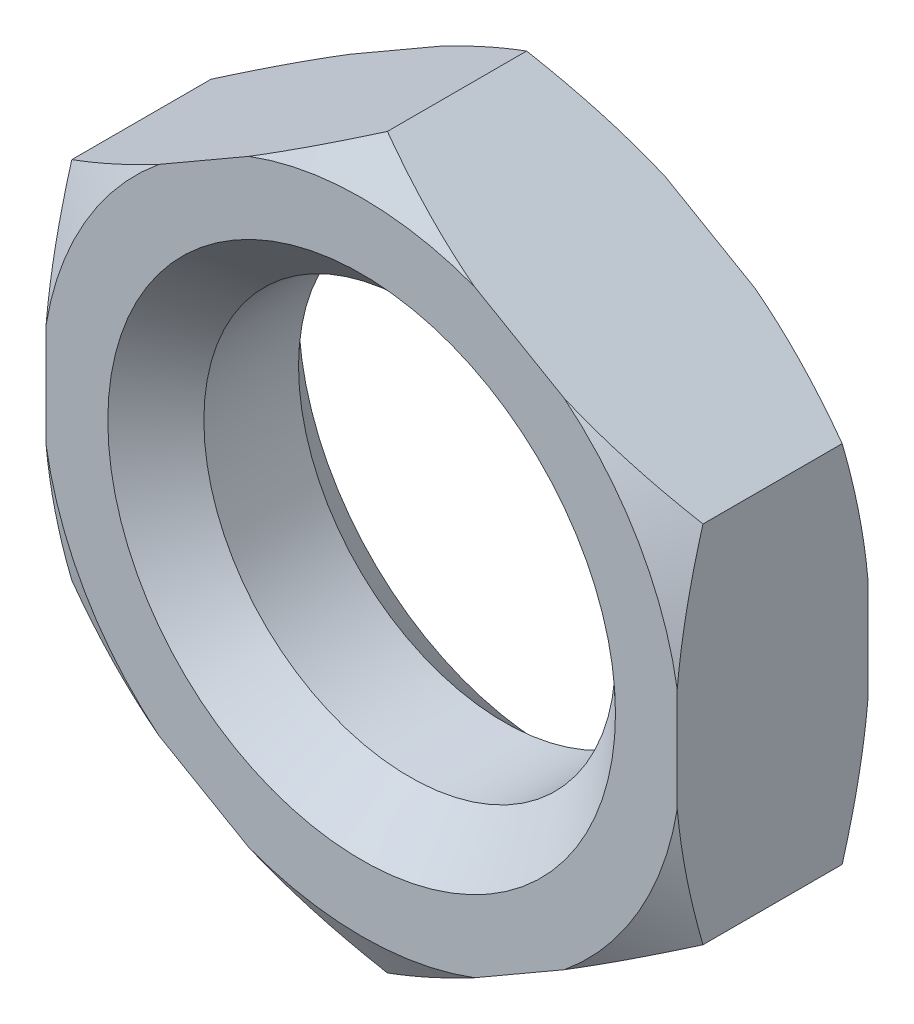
from build123d import *

# Parameters (mm, degrees)
BOSS_EXTRUDE1_DEPTH = 6.95
SKETCH6_R           = 15
CUT_EXTRUDE1_DEPTH  = 13.9
CHAMFER1_SIZE       = 3.5


with BuildPart() as part:
    # Sketch3 → Boss-Extrude1 (new, symmetric)
    with BuildSketch(Plane.XY):
        Polygon((0, 26.558112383), (-23, 13.279056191), (-23, -13.279056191), (0, -26.558112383), (23, -13.279056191), (23, 13.279056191), align=None)
    extrude(amount=BOSS_EXTRUDE1_DEPTH, both=True)

    # Sketch5 → Cut-Revolve1 (revolve, cut)
    with BuildSketch(Plane(origin=(0, 0, 0), x_dir=(0, 0, -1), z_dir=(1, 0, 0))):
        Polygon((-6.95, 26.558112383), (-6.95, 23.308112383), (-5.073611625, 26.558112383), align=None)
    cut_revolve1 = revolve(axis=Axis((0, 0, 5.457798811), (0, 0, -1)), mode=Mode.SUBTRACT)

    # Mirror1: Cut-Revolve1 across plane
    add(cut_revolve1.mirror(Plane.XY), mode=Mode.SUBTRACT)

    # Sketch6 → Cut-Extrude1 (cut)
    with BuildSketch(Plane.XY.offset(6.95)):
        Circle(SKETCH6_R)
    extrude(amount=-CUT_EXTRUDE1_DEPTH, mode=Mode.SUBTRACT)

    # Chamfer1
    chamfer1_edges = [part.edges().sort_by_distance(p)[0] for p in [
        (-15, 0, -6.95),
        (-15, 0, 6.95),
    ]]
    chamfer(chamfer1_edges, length=CHAMFER1_SIZE)


solid = part.part
